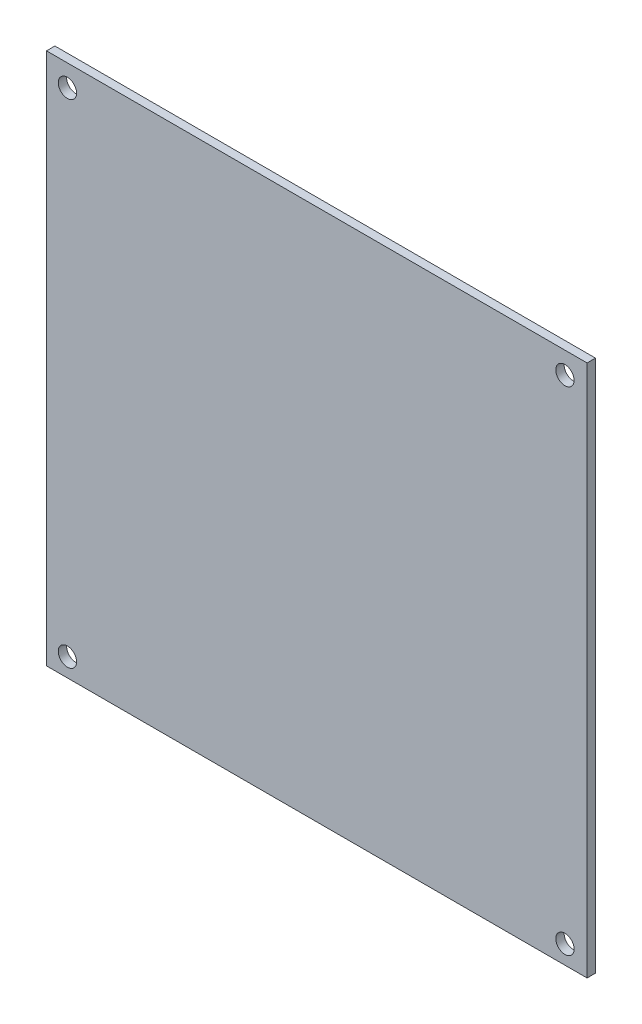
ISO-10303-21;
HEADER;
FILE_DESCRIPTION(('STEP AP214'),'2;1');
FILE_NAME('part.step','',(''),(''),'','','');
FILE_SCHEMA(('AUTOMOTIVE_DESIGN { 1 0 10303 214 1 1 1 1 }'));
ENDSEC;
DATA;
#1=APPLICATION_CONTEXT('core data for automotive mechanical design processes');
#2=APPLICATION_PROTOCOL_DEFINITION('international standard','automotive_design',2000,#1);
#3=PRODUCT_CONTEXT('',#1,'mechanical');
#4=PRODUCT('Part','Part','',(#3));
#5=PRODUCT_RELATED_PRODUCT_CATEGORY('part','',(#4));
#6=PRODUCT_DEFINITION_FORMATION('','',#4);
#7=PRODUCT_DEFINITION_CONTEXT('part definition',#1,'design');
#8=PRODUCT_DEFINITION('design','',#6,#7);
#9=PRODUCT_DEFINITION_SHAPE('','',#8);
#10=(LENGTH_UNIT() NAMED_UNIT(*) SI_UNIT(.MILLI.,.METRE.));
#11=(NAMED_UNIT(*) PLANE_ANGLE_UNIT() SI_UNIT($,.RADIAN.));
#12=(NAMED_UNIT(*) SI_UNIT($,.STERADIAN.) SOLID_ANGLE_UNIT());
#13=UNCERTAINTY_MEASURE_WITH_UNIT(LENGTH_MEASURE(1.E-05),#10,'distance_accuracy_value','');
#14=(GEOMETRIC_REPRESENTATION_CONTEXT(3) GLOBAL_UNCERTAINTY_ASSIGNED_CONTEXT((#13)) GLOBAL_UNIT_ASSIGNED_CONTEXT((#10,
#11,#12)) REPRESENTATION_CONTEXT('',''));
#15=CARTESIAN_POINT('',(0.,0.,0.));
#16=DIRECTION('',(0.,0.,1.));
#17=DIRECTION('',(1.,0.,0.));
#18=AXIS2_PLACEMENT_3D('',#15,#16,#17);
#19=CARTESIAN_POINT('',(0.,0.,1.6));
#20=DIRECTION('',(0.,1.,0.));
#21=DIRECTION('',(0.,0.,1.));
#22=AXIS2_PLACEMENT_3D('',#19,#20,#21);
#23=PLANE('',#22);
#24=DIRECTION('',(0.,0.,1.));
#25=VECTOR('',#24,1.);
#26=CARTESIAN_POINT('',(94.1032282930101,0.,1.6));
#27=LINE('',#26,#25);
#28=CARTESIAN_POINT('',(94.1032282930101,0.,0.));
#29=VERTEX_POINT('',#28);
#30=CARTESIAN_POINT('',(94.1032282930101,0.,1.6));
#31=VERTEX_POINT('',#30);
#32=EDGE_CURVE('E79',#29,#31,#27,.T.);
#33=ORIENTED_EDGE('',*,*,#32,.F.);
#34=DIRECTION('',(1.,0.,0.));
#35=VECTOR('',#34,1.);
#36=CARTESIAN_POINT('',(0.,0.,0.));
#37=LINE('',#36,#35);
#38=CARTESIAN_POINT('',(197.209727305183,0.,0.));
#39=VERTEX_POINT('',#38);
#40=EDGE_CURVE('E105',#29,#39,#37,.T.);
#41=ORIENTED_EDGE('',*,*,#40,.T.);
#42=DIRECTION('',(0.,0.,-1.));
#43=VECTOR('',#42,1.);
#44=CARTESIAN_POINT('',(197.209727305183,0.,1.6));
#45=LINE('',#44,#43);
#46=CARTESIAN_POINT('',(197.209727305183,0.,1.6));
#47=VERTEX_POINT('',#46);
#48=EDGE_CURVE('E52',#47,#39,#45,.T.);
#49=ORIENTED_EDGE('',*,*,#48,.F.);
#50=DIRECTION('',(1.,0.,0.));
#51=VECTOR('',#50,1.);
#52=CARTESIAN_POINT('',(0.,0.,1.6));
#53=LINE('',#52,#51);
#54=EDGE_CURVE('E44',#31,#47,#53,.T.);
#55=ORIENTED_EDGE('',*,*,#54,.F.);
#56=EDGE_LOOP('',(#33,#41,#49,#55));
#57=FACE_BOUND('',#56,.T.);
#58=ADVANCED_FACE('F36',(#57),#23,.F.);
#59=CARTESIAN_POINT('',(0.,101.6,1.6));
#60=DIRECTION('',(0.,-1.,0.));
#61=DIRECTION('',(0.,0.,-1.));
#62=AXIS2_PLACEMENT_3D('',#59,#60,#61);
#63=PLANE('',#62);
#64=DIRECTION('',(0.,0.,-1.));
#65=VECTOR('',#64,1.);
#66=CARTESIAN_POINT('',(94.1032282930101,101.6,1.6));
#67=LINE('',#66,#65);
#68=CARTESIAN_POINT('',(94.1032282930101,101.6,1.6));
#69=VERTEX_POINT('',#68);
#70=CARTESIAN_POINT('',(94.1032282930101,101.6,0.));
#71=VERTEX_POINT('',#70);
#72=EDGE_CURVE('E60',#69,#71,#67,.T.);
#73=ORIENTED_EDGE('',*,*,#72,.F.);
#74=DIRECTION('',(-1.,0.,0.));
#75=VECTOR('',#74,1.);
#76=CARTESIAN_POINT('',(0.,101.6,1.6));
#77=LINE('',#76,#75);
#78=CARTESIAN_POINT('',(197.209727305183,101.6,1.6));
#79=VERTEX_POINT('',#78);
#80=EDGE_CURVE('E12',#79,#69,#77,.T.);
#81=ORIENTED_EDGE('',*,*,#80,.F.);
#82=DIRECTION('',(0.,0.,1.));
#83=VECTOR('',#82,1.);
#84=CARTESIAN_POINT('',(197.209727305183,101.6,1.6));
#85=LINE('',#84,#83);
#86=CARTESIAN_POINT('',(197.209727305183,101.6,0.));
#87=VERTEX_POINT('',#86);
#88=EDGE_CURVE('E101',#87,#79,#85,.T.);
#89=ORIENTED_EDGE('',*,*,#88,.F.);
#90=DIRECTION('',(-1.,0.,0.));
#91=VECTOR('',#90,1.);
#92=CARTESIAN_POINT('',(0.,101.6,0.));
#93=LINE('',#92,#91);
#94=EDGE_CURVE('E39',#87,#71,#93,.T.);
#95=ORIENTED_EDGE('',*,*,#94,.T.);
#96=EDGE_LOOP('',(#73,#81,#89,#95));
#97=FACE_BOUND('',#96,.T.);
#98=ADVANCED_FACE('F89',(#97),#63,.F.);
#99=CARTESIAN_POINT('',(0.,101.6,1.6));
#100=DIRECTION('',(0.,0.,-1.));
#101=DIRECTION('',(-1.,0.,0.));
#102=AXIS2_PLACEMENT_3D('',#99,#100,#101);
#103=PLANE('',#102);
#104=CARTESIAN_POINT('',(98.0872888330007,3.52849056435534,1.6));
#105=DIRECTION('',(0.,0.,1.));
#106=DIRECTION('',(1.,0.,0.));
#107=AXIS2_PLACEMENT_3D('',#104,#105,#106);
#108=CIRCLE('',#107,1.75);
#109=CARTESIAN_POINT('',(99.8372888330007,3.52849056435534,1.6));
#110=VERTEX_POINT('',#109);
#111=EDGE_CURVE('E130',#110,#110,#108,.T.);
#112=ORIENTED_EDGE('',*,*,#111,.F.);
#113=EDGE_LOOP('',(#112));
#114=FACE_BOUND('',#113,.T.);
#115=CARTESIAN_POINT('',(192.987523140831,3.52849056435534,1.6));
#116=DIRECTION('',(0.,0.,1.));
#117=DIRECTION('',(1.,0.,0.));
#118=AXIS2_PLACEMENT_3D('',#115,#116,#117);
#119=CIRCLE('',#118,1.75000000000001);
#120=CARTESIAN_POINT('',(194.737523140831,3.52849056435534,1.6));
#121=VERTEX_POINT('',#120);
#122=EDGE_CURVE('E124',#121,#121,#119,.T.);
#123=ORIENTED_EDGE('',*,*,#122,.F.);
#124=EDGE_LOOP('',(#123));
#125=FACE_BOUND('',#124,.T.);
#126=CARTESIAN_POINT('',(192.987523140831,97.4761503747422,1.6));
#127=DIRECTION('',(0.,0.,1.));
#128=DIRECTION('',(1.,0.,0.));
#129=AXIS2_PLACEMENT_3D('',#126,#127,#128);
#130=CIRCLE('',#129,1.75000000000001);
#131=CARTESIAN_POINT('',(194.737523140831,97.4761503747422,1.6));
#132=VERTEX_POINT('',#131);
#133=EDGE_CURVE('E118',#132,#132,#130,.T.);
#134=ORIENTED_EDGE('',*,*,#133,.F.);
#135=EDGE_LOOP('',(#134));
#136=FACE_BOUND('',#135,.T.);
#137=CARTESIAN_POINT('',(98.0872888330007,97.4761503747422,1.6));
#138=DIRECTION('',(0.,0.,1.));
#139=DIRECTION('',(1.,0.,0.));
#140=AXIS2_PLACEMENT_3D('',#137,#138,#139);
#141=CIRCLE('',#140,1.75);
#142=CARTESIAN_POINT('',(99.8372888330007,97.4761503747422,1.6));
#143=VERTEX_POINT('',#142);
#144=EDGE_CURVE('E112',#143,#143,#141,.T.);
#145=ORIENTED_EDGE('',*,*,#144,.F.);
#146=EDGE_LOOP('',(#145));
#147=FACE_BOUND('',#146,.T.);
#148=DIRECTION('',(0.,-1.,0.));
#149=VECTOR('',#148,1.);
#150=CARTESIAN_POINT('',(94.1032282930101,107.322237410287,1.6));
#151=LINE('',#150,#149);
#152=EDGE_CURVE('E76',#69,#31,#151,.T.);
#153=ORIENTED_EDGE('',*,*,#152,.T.);
#154=ORIENTED_EDGE('',*,*,#54,.T.);
#155=DIRECTION('',(0.,1.,0.));
#156=VECTOR('',#155,1.);
#157=CARTESIAN_POINT('',(197.209727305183,107.322237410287,1.6));
#158=LINE('',#157,#156);
#159=EDGE_CURVE('E83',#47,#79,#158,.T.);
#160=ORIENTED_EDGE('',*,*,#159,.T.);
#161=ORIENTED_EDGE('',*,*,#80,.T.);
#162=EDGE_LOOP('',(#153,#154,#160,#161));
#163=FACE_BOUND('',#162,.T.);
#164=ADVANCED_FACE('F94',(#114,#125,#136,#147,#163),#103,.F.);
#165=CARTESIAN_POINT('',(0.,101.6,0.));
#166=DIRECTION('',(0.,0.,-1.));
#167=DIRECTION('',(-1.,0.,0.));
#168=AXIS2_PLACEMENT_3D('',#165,#166,#167);
#169=PLANE('',#168);
#170=CARTESIAN_POINT('',(98.0872888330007,3.52849056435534,0.));
#171=DIRECTION('',(0.,0.,1.));
#172=DIRECTION('',(1.,0.,0.));
#173=AXIS2_PLACEMENT_3D('',#170,#171,#172);
#174=CIRCLE('',#173,1.75);
#175=CARTESIAN_POINT('',(99.8372888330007,3.52849056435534,0.));
#176=VERTEX_POINT('',#175);
#177=EDGE_CURVE('E127',#176,#176,#174,.T.);
#178=ORIENTED_EDGE('',*,*,#177,.T.);
#179=EDGE_LOOP('',(#178));
#180=FACE_BOUND('',#179,.T.);
#181=CARTESIAN_POINT('',(192.987523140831,3.52849056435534,0.));
#182=DIRECTION('',(0.,0.,1.));
#183=DIRECTION('',(1.,0.,0.));
#184=AXIS2_PLACEMENT_3D('',#181,#182,#183);
#185=CIRCLE('',#184,1.75000000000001);
#186=CARTESIAN_POINT('',(194.737523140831,3.52849056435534,0.));
#187=VERTEX_POINT('',#186);
#188=EDGE_CURVE('E121',#187,#187,#185,.T.);
#189=ORIENTED_EDGE('',*,*,#188,.T.);
#190=EDGE_LOOP('',(#189));
#191=FACE_BOUND('',#190,.T.);
#192=CARTESIAN_POINT('',(192.987523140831,97.4761503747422,0.));
#193=DIRECTION('',(0.,0.,1.));
#194=DIRECTION('',(1.,0.,0.));
#195=AXIS2_PLACEMENT_3D('',#192,#193,#194);
#196=CIRCLE('',#195,1.75000000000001);
#197=CARTESIAN_POINT('',(194.737523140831,97.4761503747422,0.));
#198=VERTEX_POINT('',#197);
#199=EDGE_CURVE('E115',#198,#198,#196,.T.);
#200=ORIENTED_EDGE('',*,*,#199,.T.);
#201=EDGE_LOOP('',(#200));
#202=FACE_BOUND('',#201,.T.);
#203=CARTESIAN_POINT('',(98.0872888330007,97.4761503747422,0.));
#204=DIRECTION('',(0.,0.,1.));
#205=DIRECTION('',(1.,0.,0.));
#206=AXIS2_PLACEMENT_3D('',#203,#204,#205);
#207=CIRCLE('',#206,1.75);
#208=CARTESIAN_POINT('',(99.8372888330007,97.4761503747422,0.));
#209=VERTEX_POINT('',#208);
#210=EDGE_CURVE('E84',#209,#209,#207,.T.);
#211=ORIENTED_EDGE('',*,*,#210,.T.);
#212=EDGE_LOOP('',(#211));
#213=FACE_BOUND('',#212,.T.);
#214=ORIENTED_EDGE('',*,*,#40,.F.);
#215=DIRECTION('',(0.,-1.,0.));
#216=VECTOR('',#215,1.);
#217=CARTESIAN_POINT('',(94.1032282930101,107.322237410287,0.));
#218=LINE('',#217,#216);
#219=EDGE_CURVE('E95',#71,#29,#218,.T.);
#220=ORIENTED_EDGE('',*,*,#219,.F.);
#221=ORIENTED_EDGE('',*,*,#94,.F.);
#222=DIRECTION('',(0.,1.,0.));
#223=VECTOR('',#222,1.);
#224=CARTESIAN_POINT('',(197.209727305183,107.322237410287,0.));
#225=LINE('',#224,#223);
#226=EDGE_CURVE('E97',#39,#87,#225,.T.);
#227=ORIENTED_EDGE('',*,*,#226,.F.);
#228=EDGE_LOOP('',(#214,#220,#221,#227));
#229=FACE_BOUND('',#228,.T.);
#230=ADVANCED_FACE('F110',(#180,#191,#202,#213,#229),#169,.T.);
#231=CARTESIAN_POINT('',(197.209727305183,107.322237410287,0.));
#232=DIRECTION('',(1.,0.,0.));
#233=DIRECTION('',(0.,0.,-1.));
#234=AXIS2_PLACEMENT_3D('',#231,#232,#233);
#235=PLANE('',#234);
#236=ORIENTED_EDGE('',*,*,#48,.T.);
#237=ORIENTED_EDGE('',*,*,#226,.T.);
#238=ORIENTED_EDGE('',*,*,#88,.T.);
#239=ORIENTED_EDGE('',*,*,#159,.F.);
#240=EDGE_LOOP('',(#236,#237,#238,#239));
#241=FACE_BOUND('',#240,.T.);
#242=ADVANCED_FACE('F165',(#241),#235,.T.);
#243=CARTESIAN_POINT('',(94.1032282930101,107.322237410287,0.));
#244=DIRECTION('',(-1.,0.,0.));
#245=DIRECTION('',(0.,-1.,0.));
#246=AXIS2_PLACEMENT_3D('',#243,#244,#245);
#247=PLANE('',#246);
#248=ORIENTED_EDGE('',*,*,#32,.T.);
#249=ORIENTED_EDGE('',*,*,#152,.F.);
#250=ORIENTED_EDGE('',*,*,#72,.T.);
#251=ORIENTED_EDGE('',*,*,#219,.T.);
#252=EDGE_LOOP('',(#248,#249,#250,#251));
#253=FACE_BOUND('',#252,.T.);
#254=ADVANCED_FACE('F77',(#253),#247,.T.);
#255=CARTESIAN_POINT('',(98.0872888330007,97.4761503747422,0.));
#256=DIRECTION('',(0.,0.,1.));
#257=DIRECTION('',(1.,0.,0.));
#258=AXIS2_PLACEMENT_3D('',#255,#256,#257);
#259=CYLINDRICAL_SURFACE('',#258,1.75);
#260=ORIENTED_EDGE('',*,*,#210,.F.);
#261=EDGE_LOOP('',(#260));
#262=FACE_BOUND('',#261,.T.);
#263=ORIENTED_EDGE('',*,*,#144,.T.);
#264=EDGE_LOOP('',(#263));
#265=FACE_BOUND('',#264,.T.);
#266=ADVANCED_FACE('F154',(#262,#265),#259,.F.);
#267=CARTESIAN_POINT('',(192.987523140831,97.4761503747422,0.));
#268=DIRECTION('',(0.,0.,1.));
#269=DIRECTION('',(1.,0.,0.));
#270=AXIS2_PLACEMENT_3D('',#267,#268,#269);
#271=CYLINDRICAL_SURFACE('',#270,1.75000000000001);
#272=ORIENTED_EDGE('',*,*,#199,.F.);
#273=EDGE_LOOP('',(#272));
#274=FACE_BOUND('',#273,.T.);
#275=ORIENTED_EDGE('',*,*,#133,.T.);
#276=EDGE_LOOP('',(#275));
#277=FACE_BOUND('',#276,.T.);
#278=ADVANCED_FACE('F156',(#274,#277),#271,.F.);
#279=CARTESIAN_POINT('',(192.987523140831,3.52849056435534,0.));
#280=DIRECTION('',(0.,0.,1.));
#281=DIRECTION('',(1.,0.,0.));
#282=AXIS2_PLACEMENT_3D('',#279,#280,#281);
#283=CYLINDRICAL_SURFACE('',#282,1.75000000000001);
#284=ORIENTED_EDGE('',*,*,#188,.F.);
#285=EDGE_LOOP('',(#284));
#286=FACE_BOUND('',#285,.T.);
#287=ORIENTED_EDGE('',*,*,#122,.T.);
#288=EDGE_LOOP('',(#287));
#289=FACE_BOUND('',#288,.T.);
#290=ADVANCED_FACE('F141',(#286,#289),#283,.F.);
#291=CARTESIAN_POINT('',(98.0872888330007,3.52849056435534,0.));
#292=DIRECTION('',(0.,0.,1.));
#293=DIRECTION('',(1.,0.,0.));
#294=AXIS2_PLACEMENT_3D('',#291,#292,#293);
#295=CYLINDRICAL_SURFACE('',#294,1.75);
#296=ORIENTED_EDGE('',*,*,#177,.F.);
#297=EDGE_LOOP('',(#296));
#298=FACE_BOUND('',#297,.T.);
#299=ORIENTED_EDGE('',*,*,#111,.T.);
#300=EDGE_LOOP('',(#299));
#301=FACE_BOUND('',#300,.T.);
#302=ADVANCED_FACE('F138',(#298,#301),#295,.F.);
#303=CLOSED_SHELL('',(#58,#98,#164,#230,#242,#254,#266,#278,#290,#302));
#304=MANIFOLD_SOLID_BREP('B2',#303);
#305=ADVANCED_BREP_SHAPE_REPRESENTATION('',(#18,#304),#14);
#306=SHAPE_DEFINITION_REPRESENTATION(#9,#305);
ENDSEC;
END-ISO-10303-21;
